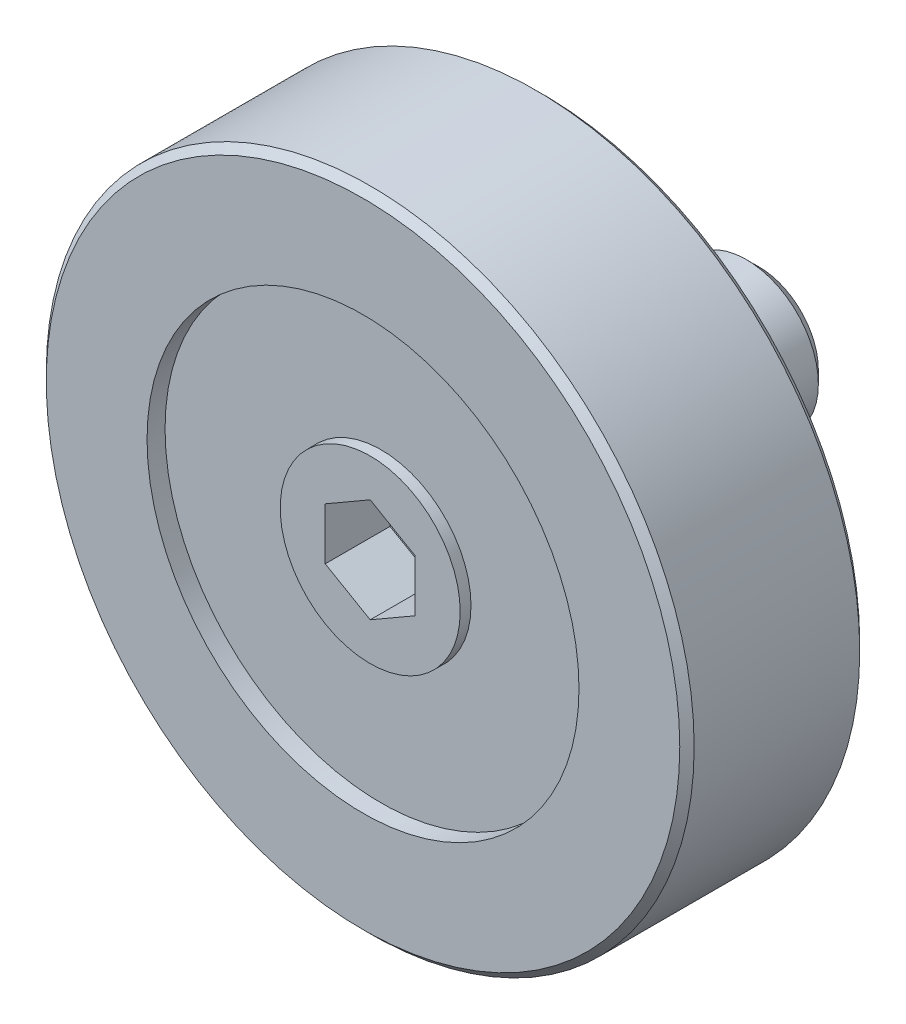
ISO-10303-21;
HEADER;
FILE_DESCRIPTION(('STEP AP214'),'2;1');
FILE_NAME('part.step','',(''),(''),'','','');
FILE_SCHEMA(('AUTOMOTIVE_DESIGN { 1 0 10303 214 1 1 1 1 }'));
ENDSEC;
DATA;
#1=APPLICATION_CONTEXT('core data for automotive mechanical design processes');
#2=APPLICATION_PROTOCOL_DEFINITION('international standard','automotive_design',2000,#1);
#3=PRODUCT_CONTEXT('',#1,'mechanical');
#4=PRODUCT('Part','Part','',(#3));
#5=PRODUCT_RELATED_PRODUCT_CATEGORY('part','',(#4));
#6=PRODUCT_DEFINITION_FORMATION('','',#4);
#7=PRODUCT_DEFINITION_CONTEXT('part definition',#1,'design');
#8=PRODUCT_DEFINITION('design','',#6,#7);
#9=PRODUCT_DEFINITION_SHAPE('','',#8);
#10=(LENGTH_UNIT() NAMED_UNIT(*) SI_UNIT(.MILLI.,.METRE.));
#11=(NAMED_UNIT(*) PLANE_ANGLE_UNIT() SI_UNIT($,.RADIAN.));
#12=(NAMED_UNIT(*) SI_UNIT($,.STERADIAN.) SOLID_ANGLE_UNIT());
#13=UNCERTAINTY_MEASURE_WITH_UNIT(LENGTH_MEASURE(1.E-05),#10,'distance_accuracy_value','');
#14=(GEOMETRIC_REPRESENTATION_CONTEXT(3) GLOBAL_UNCERTAINTY_ASSIGNED_CONTEXT((#13)) GLOBAL_UNIT_ASSIGNED_CONTEXT((#10,
#11,#12)) REPRESENTATION_CONTEXT('',''));
#15=CARTESIAN_POINT('',(0.,0.,0.));
#16=DIRECTION('',(0.,0.,1.));
#17=DIRECTION('',(1.,0.,0.));
#18=AXIS2_PLACEMENT_3D('',#15,#16,#17);
#19=CARTESIAN_POINT('',(0.,8.8,5.99999999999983));
#20=DIRECTION('',(0.,0.,1.));
#21=DIRECTION('',(1.,0.,0.));
#22=AXIS2_PLACEMENT_3D('',#19,#20,#21);
#23=PLANE('',#22);
#24=CARTESIAN_POINT('',(0.,0.,5.99999999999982));
#25=DIRECTION('',(0.,0.,1.));
#26=DIRECTION('',(1.,0.,0.));
#27=AXIS2_PLACEMENT_3D('',#24,#25,#26);
#28=CIRCLE('',#27,8.8);
#29=CARTESIAN_POINT('',(8.8,0.,5.99999999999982));
#30=VERTEX_POINT('',#29);
#31=EDGE_CURVE('E115',#30,#30,#28,.T.);
#32=ORIENTED_EDGE('',*,*,#31,.T.);
#33=EDGE_LOOP('',(#32));
#34=FACE_BOUND('',#33,.T.);
#35=CARTESIAN_POINT('',(0.,0.,5.99999999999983));
#36=DIRECTION('',(0.,0.,1.));
#37=DIRECTION('',(1.,0.,0.));
#38=AXIS2_PLACEMENT_3D('',#35,#36,#37);
#39=CIRCLE('',#38,6.00000000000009);
#40=CARTESIAN_POINT('',(6.00000000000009,0.,5.99999999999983));
#41=VERTEX_POINT('',#40);
#42=EDGE_CURVE('E9',#41,#41,#39,.T.);
#43=ORIENTED_EDGE('',*,*,#42,.F.);
#44=EDGE_LOOP('',(#43));
#45=FACE_BOUND('',#44,.T.);
#46=ADVANCED_FACE('F14',(#34,#45),#23,.T.);
#47=CARTESIAN_POINT('',(0.,0.,9.));
#48=DIRECTION('',(0.,0.,1.));
#49=DIRECTION('',(1.,0.,0.));
#50=AXIS2_PLACEMENT_3D('',#47,#48,#49);
#51=CYLINDRICAL_SURFACE('',#50,6.00000000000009);
#52=ORIENTED_EDGE('',*,*,#42,.T.);
#53=EDGE_LOOP('',(#52));
#54=FACE_BOUND('',#53,.T.);
#55=CARTESIAN_POINT('',(0.,0.,5.49999999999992));
#56=DIRECTION('',(0.,0.,1.));
#57=DIRECTION('',(1.,0.,0.));
#58=AXIS2_PLACEMENT_3D('',#55,#56,#57);
#59=CIRCLE('',#58,6.00000000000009);
#60=CARTESIAN_POINT('',(6.00000000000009,0.,5.49999999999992));
#61=VERTEX_POINT('',#60);
#62=EDGE_CURVE('E21',#61,#61,#59,.T.);
#63=ORIENTED_EDGE('',*,*,#62,.F.);
#64=EDGE_LOOP('',(#63));
#65=FACE_BOUND('',#64,.T.);
#66=ADVANCED_FACE('F170',(#54,#65),#51,.F.);
#67=CARTESIAN_POINT('',(0.,6.00000000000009,5.5));
#68=DIRECTION('',(0.,0.,1.));
#69=DIRECTION('',(1.,0.,0.));
#70=AXIS2_PLACEMENT_3D('',#67,#68,#69);
#71=PLANE('',#70);
#72=ORIENTED_EDGE('',*,*,#62,.T.);
#73=EDGE_LOOP('',(#72));
#74=FACE_BOUND('',#73,.T.);
#75=CARTESIAN_POINT('',(0.,0.,5.5));
#76=DIRECTION('',(0.,0.,1.));
#77=DIRECTION('',(1.,0.,0.));
#78=AXIS2_PLACEMENT_3D('',#75,#76,#77);
#79=CIRCLE('',#78,2.5);
#80=CARTESIAN_POINT('',(2.5,0.,5.5));
#81=VERTEX_POINT('',#80);
#82=EDGE_CURVE('E162',#81,#81,#79,.T.);
#83=ORIENTED_EDGE('',*,*,#82,.F.);
#84=EDGE_LOOP('',(#83));
#85=FACE_BOUND('',#84,.T.);
#86=ADVANCED_FACE('F167',(#74,#85),#71,.T.);
#87=CARTESIAN_POINT('',(0.,0.,9.));
#88=DIRECTION('',(0.,0.,1.));
#89=DIRECTION('',(1.,0.,0.));
#90=AXIS2_PLACEMENT_3D('',#87,#88,#89);
#91=CYLINDRICAL_SURFACE('',#90,2.5);
#92=ORIENTED_EDGE('',*,*,#82,.T.);
#93=EDGE_LOOP('',(#92));
#94=FACE_BOUND('',#93,.T.);
#95=CARTESIAN_POINT('',(0.,0.,5.8));
#96=DIRECTION('',(0.,0.,1.));
#97=DIRECTION('',(1.,0.,0.));
#98=AXIS2_PLACEMENT_3D('',#95,#96,#97);
#99=CIRCLE('',#98,2.5);
#100=CARTESIAN_POINT('',(2.5,0.,5.8));
#101=VERTEX_POINT('',#100);
#102=EDGE_CURVE('E159',#101,#101,#99,.T.);
#103=ORIENTED_EDGE('',*,*,#102,.F.);
#104=EDGE_LOOP('',(#103));
#105=FACE_BOUND('',#104,.T.);
#106=ADVANCED_FACE('F179',(#94,#105),#91,.T.);
#107=CARTESIAN_POINT('',(0.,2.5,5.8));
#108=DIRECTION('',(0.,0.,1.));
#109=DIRECTION('',(1.,0.,0.));
#110=AXIS2_PLACEMENT_3D('',#107,#108,#109);
#111=PLANE('',#110);
#112=DIRECTION('',(-0.866025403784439,0.5,0.));
#113=VECTOR('',#112,1.);
#114=CARTESIAN_POINT('',(1.25,0.721687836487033,5.8));
#115=LINE('',#114,#113);
#116=CARTESIAN_POINT('',(1.25,0.721687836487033,5.8));
#117=VERTEX_POINT('',#116);
#118=CARTESIAN_POINT('',(0.,1.44337567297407,5.8));
#119=VERTEX_POINT('',#118);
#120=EDGE_CURVE('E28',#117,#119,#115,.T.);
#121=ORIENTED_EDGE('',*,*,#120,.F.);
#122=DIRECTION('',(0.,1.,0.));
#123=VECTOR('',#122,1.);
#124=CARTESIAN_POINT('',(1.25,-0.721687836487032,5.8));
#125=LINE('',#124,#123);
#126=CARTESIAN_POINT('',(1.25,-0.721687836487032,5.8));
#127=VERTEX_POINT('',#126);
#128=EDGE_CURVE('E111',#127,#117,#125,.T.);
#129=ORIENTED_EDGE('',*,*,#128,.F.);
#130=DIRECTION('',(0.866025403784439,0.5,0.));
#131=VECTOR('',#130,1.);
#132=CARTESIAN_POINT('',(0.,-1.44337567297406,5.8));
#133=LINE('',#132,#131);
#134=CARTESIAN_POINT('',(0.,-1.44337567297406,5.8));
#135=VERTEX_POINT('',#134);
#136=EDGE_CURVE('E109',#135,#127,#133,.T.);
#137=ORIENTED_EDGE('',*,*,#136,.F.);
#138=DIRECTION('',(0.866025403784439,-0.5,0.));
#139=VECTOR('',#138,1.);
#140=CARTESIAN_POINT('',(-1.25,-0.721687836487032,5.8));
#141=LINE('',#140,#139);
#142=CARTESIAN_POINT('',(-1.25,-0.721687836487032,5.8));
#143=VERTEX_POINT('',#142);
#144=EDGE_CURVE('E76',#143,#135,#141,.T.);
#145=ORIENTED_EDGE('',*,*,#144,.F.);
#146=DIRECTION('',(0.,-1.,0.));
#147=VECTOR('',#146,1.);
#148=CARTESIAN_POINT('',(-1.25,0.721687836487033,5.8));
#149=LINE('',#148,#147);
#150=CARTESIAN_POINT('',(-1.25,0.721687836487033,5.8));
#151=VERTEX_POINT('',#150);
#152=EDGE_CURVE('E105',#151,#143,#149,.T.);
#153=ORIENTED_EDGE('',*,*,#152,.F.);
#154=DIRECTION('',(-0.866025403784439,-0.5,0.));
#155=VECTOR('',#154,1.);
#156=CARTESIAN_POINT('',(0.,1.44337567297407,5.8));
#157=LINE('',#156,#155);
#158=EDGE_CURVE('E102',#119,#151,#157,.T.);
#159=ORIENTED_EDGE('',*,*,#158,.F.);
#160=EDGE_LOOP('',(#121,#129,#137,#145,#153,#159));
#161=FACE_BOUND('',#160,.T.);
#162=ORIENTED_EDGE('',*,*,#102,.T.);
#163=EDGE_LOOP('',(#162));
#164=FACE_BOUND('',#163,.T.);
#165=ADVANCED_FACE('F185',(#161,#164),#111,.T.);
#166=CARTESIAN_POINT('',(0.,0.,-5.));
#167=DIRECTION('',(0.,0.,-1.));
#168=DIRECTION('',(-1.,0.,0.));
#169=AXIS2_PLACEMENT_3D('',#166,#167,#168);
#170=PLANE('',#169);
#171=CARTESIAN_POINT('',(0.,0.,-5.));
#172=DIRECTION('',(0.,0.,1.));
#173=DIRECTION('',(1.,0.,0.));
#174=AXIS2_PLACEMENT_3D('',#171,#172,#173);
#175=CIRCLE('',#174,1.65);
#176=CARTESIAN_POINT('',(1.65,0.,-5.));
#177=VERTEX_POINT('',#176);
#178=EDGE_CURVE('E156',#177,#177,#175,.T.);
#179=ORIENTED_EDGE('',*,*,#178,.F.);
#180=EDGE_LOOP('',(#179));
#181=FACE_BOUND('',#180,.T.);
#182=ADVANCED_FACE('F189',(#181),#170,.T.);
#183=CARTESIAN_POINT('',(0.,0.,-4.65));
#184=DIRECTION('',(0.,0.,1.));
#185=DIRECTION('',(1.,0.,0.));
#186=AXIS2_PLACEMENT_3D('',#183,#184,#185);
#187=CONICAL_SURFACE('',#186,2.,0.785398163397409);
#188=ORIENTED_EDGE('',*,*,#178,.T.);
#189=EDGE_LOOP('',(#188));
#190=FACE_BOUND('',#189,.T.);
#191=CARTESIAN_POINT('',(0.,0.,-4.65));
#192=DIRECTION('',(0.,0.,1.));
#193=DIRECTION('',(1.,0.,0.));
#194=AXIS2_PLACEMENT_3D('',#191,#192,#193);
#195=CIRCLE('',#194,2.);
#196=CARTESIAN_POINT('',(2.,0.,-4.65));
#197=VERTEX_POINT('',#196);
#198=EDGE_CURVE('E153',#197,#197,#195,.T.);
#199=ORIENTED_EDGE('',*,*,#198,.F.);
#200=EDGE_LOOP('',(#199));
#201=FACE_BOUND('',#200,.T.);
#202=ADVANCED_FACE('F193',(#190,#201),#187,.T.);
#203=CARTESIAN_POINT('',(0.,0.,9.));
#204=DIRECTION('',(0.,0.,1.));
#205=DIRECTION('',(1.,0.,0.));
#206=AXIS2_PLACEMENT_3D('',#203,#204,#205);
#207=CYLINDRICAL_SURFACE('',#206,2.);
#208=ORIENTED_EDGE('',*,*,#198,.T.);
#209=EDGE_LOOP('',(#208));
#210=FACE_BOUND('',#209,.T.);
#211=CARTESIAN_POINT('',(0.,0.,-1.));
#212=DIRECTION('',(0.,0.,1.));
#213=DIRECTION('',(1.,0.,0.));
#214=AXIS2_PLACEMENT_3D('',#211,#212,#213);
#215=CIRCLE('',#214,2.);
#216=CARTESIAN_POINT('',(2.,0.,-1.));
#217=VERTEX_POINT('',#216);
#218=EDGE_CURVE('E150',#217,#217,#215,.T.);
#219=ORIENTED_EDGE('',*,*,#218,.F.);
#220=EDGE_LOOP('',(#219));
#221=FACE_BOUND('',#220,.T.);
#222=ADVANCED_FACE('F197',(#210,#221),#207,.T.);
#223=CARTESIAN_POINT('',(0.,1.45000000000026,-1.));
#224=DIRECTION('',(0.,0.,1.));
#225=DIRECTION('',(1.,0.,0.));
#226=AXIS2_PLACEMENT_3D('',#223,#224,#225);
#227=PLANE('',#226);
#228=ORIENTED_EDGE('',*,*,#218,.T.);
#229=EDGE_LOOP('',(#228));
#230=FACE_BOUND('',#229,.T.);
#231=CARTESIAN_POINT('',(0.,0.,-1.00000000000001));
#232=DIRECTION('',(0.,0.,1.));
#233=DIRECTION('',(1.,0.,0.));
#234=AXIS2_PLACEMENT_3D('',#231,#232,#233);
#235=CIRCLE('',#234,1.45000000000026);
#236=CARTESIAN_POINT('',(1.45000000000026,0.,-1.00000000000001));
#237=VERTEX_POINT('',#236);
#238=EDGE_CURVE('E147',#237,#237,#235,.T.);
#239=ORIENTED_EDGE('',*,*,#238,.F.);
#240=EDGE_LOOP('',(#239));
#241=FACE_BOUND('',#240,.T.);
#242=ADVANCED_FACE('F201',(#230,#241),#227,.T.);
#243=CARTESIAN_POINT('',(0.,0.,9.));
#244=DIRECTION('',(0.,0.,1.));
#245=DIRECTION('',(1.,0.,0.));
#246=AXIS2_PLACEMENT_3D('',#243,#244,#245);
#247=CYLINDRICAL_SURFACE('',#246,1.45000000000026);
#248=ORIENTED_EDGE('',*,*,#238,.T.);
#249=EDGE_LOOP('',(#248));
#250=FACE_BOUND('',#249,.T.);
#251=CARTESIAN_POINT('',(0.,0.,0.));
#252=DIRECTION('',(0.,0.,1.));
#253=DIRECTION('',(1.,0.,0.));
#254=AXIS2_PLACEMENT_3D('',#251,#252,#253);
#255=CIRCLE('',#254,1.45000000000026);
#256=CARTESIAN_POINT('',(1.45000000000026,0.,0.));
#257=VERTEX_POINT('',#256);
#258=EDGE_CURVE('E144',#257,#257,#255,.T.);
#259=ORIENTED_EDGE('',*,*,#258,.F.);
#260=EDGE_LOOP('',(#259));
#261=FACE_BOUND('',#260,.T.);
#262=ADVANCED_FACE('F205',(#250,#261),#247,.T.);
#263=CARTESIAN_POINT('',(0.,3.50000000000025,0.));
#264=DIRECTION('',(0.,0.,-1.));
#265=DIRECTION('',(-1.,0.,0.));
#266=AXIS2_PLACEMENT_3D('',#263,#264,#265);
#267=PLANE('',#266);
#268=ORIENTED_EDGE('',*,*,#258,.T.);
#269=EDGE_LOOP('',(#268));
#270=FACE_BOUND('',#269,.T.);
#271=CARTESIAN_POINT('',(0.,0.,0.));
#272=DIRECTION('',(0.,0.,1.));
#273=DIRECTION('',(1.,0.,0.));
#274=AXIS2_PLACEMENT_3D('',#271,#272,#273);
#275=CIRCLE('',#274,3.50000000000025);
#276=CARTESIAN_POINT('',(3.50000000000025,0.,0.));
#277=VERTEX_POINT('',#276);
#278=EDGE_CURVE('E141',#277,#277,#275,.T.);
#279=ORIENTED_EDGE('',*,*,#278,.F.);
#280=EDGE_LOOP('',(#279));
#281=FACE_BOUND('',#280,.T.);
#282=ADVANCED_FACE('F209',(#270,#281),#267,.T.);
#283=CARTESIAN_POINT('',(0.,0.,9.));
#284=DIRECTION('',(0.,0.,1.));
#285=DIRECTION('',(1.,0.,0.));
#286=AXIS2_PLACEMENT_3D('',#283,#284,#285);
#287=CYLINDRICAL_SURFACE('',#286,3.50000000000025);
#288=ORIENTED_EDGE('',*,*,#278,.T.);
#289=EDGE_LOOP('',(#288));
#290=FACE_BOUND('',#289,.T.);
#291=CARTESIAN_POINT('',(0.,0.,1.49999999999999));
#292=DIRECTION('',(0.,0.,1.));
#293=DIRECTION('',(1.,0.,0.));
#294=AXIS2_PLACEMENT_3D('',#291,#292,#293);
#295=CIRCLE('',#294,3.50000000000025);
#296=CARTESIAN_POINT('',(3.50000000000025,0.,1.49999999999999));
#297=VERTEX_POINT('',#296);
#298=EDGE_CURVE('E138',#297,#297,#295,.T.);
#299=ORIENTED_EDGE('',*,*,#298,.F.);
#300=EDGE_LOOP('',(#299));
#301=FACE_BOUND('',#300,.T.);
#302=ADVANCED_FACE('F213',(#290,#301),#287,.T.);
#303=CARTESIAN_POINT('',(0.,3.50000000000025,1.49999999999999));
#304=DIRECTION('',(0.,0.,-1.));
#305=DIRECTION('',(-1.,0.,0.));
#306=AXIS2_PLACEMENT_3D('',#303,#304,#305);
#307=PLANE('',#306);
#308=ORIENTED_EDGE('',*,*,#298,.T.);
#309=EDGE_LOOP('',(#308));
#310=FACE_BOUND('',#309,.T.);
#311=CARTESIAN_POINT('',(0.,0.,1.49999999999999));
#312=DIRECTION('',(0.,0.,1.));
#313=DIRECTION('',(1.,0.,0.));
#314=AXIS2_PLACEMENT_3D('',#311,#312,#313);
#315=CIRCLE('',#314,6.00000000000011);
#316=CARTESIAN_POINT('',(6.00000000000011,0.,1.49999999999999));
#317=VERTEX_POINT('',#316);
#318=EDGE_CURVE('E135',#317,#317,#315,.T.);
#319=ORIENTED_EDGE('',*,*,#318,.F.);
#320=EDGE_LOOP('',(#319));
#321=FACE_BOUND('',#320,.T.);
#322=ADVANCED_FACE('F217',(#310,#321),#307,.T.);
#323=CARTESIAN_POINT('',(0.,0.,9.));
#324=DIRECTION('',(0.,0.,1.));
#325=DIRECTION('',(1.,0.,0.));
#326=AXIS2_PLACEMENT_3D('',#323,#324,#325);
#327=CYLINDRICAL_SURFACE('',#326,6.00000000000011);
#328=ORIENTED_EDGE('',*,*,#318,.T.);
#329=EDGE_LOOP('',(#328));
#330=FACE_BOUND('',#329,.T.);
#331=CARTESIAN_POINT('',(0.,0.,0.999999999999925));
#332=DIRECTION('',(0.,0.,1.));
#333=DIRECTION('',(1.,0.,0.));
#334=AXIS2_PLACEMENT_3D('',#331,#332,#333);
#335=CIRCLE('',#334,6.00000000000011);
#336=CARTESIAN_POINT('',(6.00000000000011,0.,0.999999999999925));
#337=VERTEX_POINT('',#336);
#338=EDGE_CURVE('E132',#337,#337,#335,.T.);
#339=ORIENTED_EDGE('',*,*,#338,.F.);
#340=EDGE_LOOP('',(#339));
#341=FACE_BOUND('',#340,.T.);
#342=ADVANCED_FACE('F221',(#330,#341),#327,.F.);
#343=CARTESIAN_POINT('',(0.,8.8,0.999999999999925));
#344=DIRECTION('',(0.,0.,-1.));
#345=DIRECTION('',(-1.,0.,0.));
#346=AXIS2_PLACEMENT_3D('',#343,#344,#345);
#347=PLANE('',#346);
#348=ORIENTED_EDGE('',*,*,#338,.T.);
#349=EDGE_LOOP('',(#348));
#350=FACE_BOUND('',#349,.T.);
#351=CARTESIAN_POINT('',(0.,0.,0.999999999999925));
#352=DIRECTION('',(0.,0.,1.));
#353=DIRECTION('',(1.,0.,0.));
#354=AXIS2_PLACEMENT_3D('',#351,#352,#353);
#355=CIRCLE('',#354,8.8);
#356=CARTESIAN_POINT('',(8.8,0.,0.999999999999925));
#357=VERTEX_POINT('',#356);
#358=EDGE_CURVE('E129',#357,#357,#355,.T.);
#359=ORIENTED_EDGE('',*,*,#358,.F.);
#360=EDGE_LOOP('',(#359));
#361=FACE_BOUND('',#360,.T.);
#362=ADVANCED_FACE('F225',(#350,#361),#347,.T.);
#363=CARTESIAN_POINT('',(0.,0.,1.19999999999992));
#364=DIRECTION('',(0.,0.,1.));
#365=DIRECTION('',(1.,0.,0.));
#366=AXIS2_PLACEMENT_3D('',#363,#364,#365);
#367=CONICAL_SURFACE('',#366,9.,0.785398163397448);
#368=ORIENTED_EDGE('',*,*,#358,.T.);
#369=EDGE_LOOP('',(#368));
#370=FACE_BOUND('',#369,.T.);
#371=CARTESIAN_POINT('',(0.,0.,1.19999999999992));
#372=DIRECTION('',(0.,0.,1.));
#373=DIRECTION('',(1.,0.,0.));
#374=AXIS2_PLACEMENT_3D('',#371,#372,#373);
#375=CIRCLE('',#374,9.);
#376=CARTESIAN_POINT('',(9.,0.,1.19999999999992));
#377=VERTEX_POINT('',#376);
#378=EDGE_CURVE('E126',#377,#377,#375,.T.);
#379=ORIENTED_EDGE('',*,*,#378,.F.);
#380=EDGE_LOOP('',(#379));
#381=FACE_BOUND('',#380,.T.);
#382=ADVANCED_FACE('F229',(#370,#381),#367,.T.);
#383=CARTESIAN_POINT('',(0.,0.,9.));
#384=DIRECTION('',(0.,0.,1.));
#385=DIRECTION('',(1.,0.,0.));
#386=AXIS2_PLACEMENT_3D('',#383,#384,#385);
#387=CYLINDRICAL_SURFACE('',#386,9.);
#388=ORIENTED_EDGE('',*,*,#378,.T.);
#389=EDGE_LOOP('',(#388));
#390=FACE_BOUND('',#389,.T.);
#391=CARTESIAN_POINT('',(0.,0.,5.79999999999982));
#392=DIRECTION('',(0.,0.,1.));
#393=DIRECTION('',(1.,0.,0.));
#394=AXIS2_PLACEMENT_3D('',#391,#392,#393);
#395=CIRCLE('',#394,9.);
#396=CARTESIAN_POINT('',(9.,0.,5.79999999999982));
#397=VERTEX_POINT('',#396);
#398=EDGE_CURVE('E123',#397,#397,#395,.T.);
#399=ORIENTED_EDGE('',*,*,#398,.F.);
#400=EDGE_LOOP('',(#399));
#401=FACE_BOUND('',#400,.T.);
#402=ADVANCED_FACE('F233',(#390,#401),#387,.T.);
#403=CARTESIAN_POINT('',(0.,0.,5.99999999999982));
#404=DIRECTION('',(0.,0.,-1.));
#405=DIRECTION('',(-1.,0.,0.));
#406=AXIS2_PLACEMENT_3D('',#403,#404,#405);
#407=CONICAL_SURFACE('',#406,8.8,0.785398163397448);
#408=ORIENTED_EDGE('',*,*,#398,.T.);
#409=EDGE_LOOP('',(#408));
#410=FACE_BOUND('',#409,.T.);
#411=ORIENTED_EDGE('',*,*,#31,.F.);
#412=EDGE_LOOP('',(#411));
#413=FACE_BOUND('',#412,.T.);
#414=ADVANCED_FACE('F237',(#410,#413),#407,.T.);
#415=CARTESIAN_POINT('',(1.25,0.721687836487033,4.));
#416=DIRECTION('',(0.5,0.866025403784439,0.));
#417=DIRECTION('',(-0.866025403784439,0.5,0.));
#418=AXIS2_PLACEMENT_3D('',#415,#416,#417);
#419=PLANE('',#418);
#420=ORIENTED_EDGE('',*,*,#120,.T.);
#421=DIRECTION('',(0.,0.,1.));
#422=VECTOR('',#421,1.);
#423=CARTESIAN_POINT('',(0.,1.44337567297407,4.));
#424=LINE('',#423,#422);
#425=CARTESIAN_POINT('',(0.,1.44337567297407,4.));
#426=VERTEX_POINT('',#425);
#427=EDGE_CURVE('E58',#426,#119,#424,.T.);
#428=ORIENTED_EDGE('',*,*,#427,.F.);
#429=DIRECTION('',(-0.866025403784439,0.5,0.));
#430=VECTOR('',#429,1.);
#431=CARTESIAN_POINT('',(1.25,0.721687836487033,4.));
#432=LINE('',#431,#430);
#433=CARTESIAN_POINT('',(1.25,0.721687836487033,4.));
#434=VERTEX_POINT('',#433);
#435=EDGE_CURVE('E113',#434,#426,#432,.T.);
#436=ORIENTED_EDGE('',*,*,#435,.F.);
#437=DIRECTION('',(0.,0.,1.));
#438=VECTOR('',#437,1.);
#439=CARTESIAN_POINT('',(1.25,0.721687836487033,4.));
#440=LINE('',#439,#438);
#441=EDGE_CURVE('E36',#434,#117,#440,.T.);
#442=ORIENTED_EDGE('',*,*,#441,.T.);
#443=EDGE_LOOP('',(#420,#428,#436,#442));
#444=FACE_BOUND('',#443,.T.);
#445=ADVANCED_FACE('F241',(#444),#419,.F.);
#446=CARTESIAN_POINT('',(1.25,-0.721687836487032,4.));
#447=DIRECTION('',(1.,0.,0.));
#448=DIRECTION('',(0.,0.,-1.));
#449=AXIS2_PLACEMENT_3D('',#446,#447,#448);
#450=PLANE('',#449);
#451=ORIENTED_EDGE('',*,*,#128,.T.);
#452=ORIENTED_EDGE('',*,*,#441,.F.);
#453=DIRECTION('',(0.,1.,0.));
#454=VECTOR('',#453,1.);
#455=CARTESIAN_POINT('',(1.25,-0.721687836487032,4.));
#456=LINE('',#455,#454);
#457=CARTESIAN_POINT('',(1.25,-0.721687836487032,4.));
#458=VERTEX_POINT('',#457);
#459=EDGE_CURVE('E88',#458,#434,#456,.T.);
#460=ORIENTED_EDGE('',*,*,#459,.F.);
#461=DIRECTION('',(0.,0.,1.));
#462=VECTOR('',#461,1.);
#463=CARTESIAN_POINT('',(1.25,-0.721687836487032,4.));
#464=LINE('',#463,#462);
#465=EDGE_CURVE('E80',#458,#127,#464,.T.);
#466=ORIENTED_EDGE('',*,*,#465,.T.);
#467=EDGE_LOOP('',(#451,#452,#460,#466));
#468=FACE_BOUND('',#467,.T.);
#469=ADVANCED_FACE('F245',(#468),#450,.F.);
#470=CARTESIAN_POINT('',(0.,-1.44337567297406,4.));
#471=DIRECTION('',(0.5,-0.866025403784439,0.));
#472=DIRECTION('',(0.866025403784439,0.5,0.));
#473=AXIS2_PLACEMENT_3D('',#470,#471,#472);
#474=PLANE('',#473);
#475=ORIENTED_EDGE('',*,*,#136,.T.);
#476=ORIENTED_EDGE('',*,*,#465,.F.);
#477=DIRECTION('',(0.866025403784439,0.5,0.));
#478=VECTOR('',#477,1.);
#479=CARTESIAN_POINT('',(0.,-1.44337567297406,4.));
#480=LINE('',#479,#478);
#481=CARTESIAN_POINT('',(0.,-1.44337567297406,4.));
#482=VERTEX_POINT('',#481);
#483=EDGE_CURVE('E84',#482,#458,#480,.T.);
#484=ORIENTED_EDGE('',*,*,#483,.F.);
#485=DIRECTION('',(0.,0.,1.));
#486=VECTOR('',#485,1.);
#487=CARTESIAN_POINT('',(0.,-1.44337567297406,4.));
#488=LINE('',#487,#486);
#489=EDGE_CURVE('E69',#482,#135,#488,.T.);
#490=ORIENTED_EDGE('',*,*,#489,.T.);
#491=EDGE_LOOP('',(#475,#476,#484,#490));
#492=FACE_BOUND('',#491,.T.);
#493=ADVANCED_FACE('F85',(#492),#474,.F.);
#494=CARTESIAN_POINT('',(-1.25,-0.721687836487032,4.));
#495=DIRECTION('',(-0.5,-0.866025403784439,0.));
#496=DIRECTION('',(0.866025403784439,-0.5,0.));
#497=AXIS2_PLACEMENT_3D('',#494,#495,#496);
#498=PLANE('',#497);
#499=ORIENTED_EDGE('',*,*,#144,.T.);
#500=ORIENTED_EDGE('',*,*,#489,.F.);
#501=DIRECTION('',(0.866025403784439,-0.5,0.));
#502=VECTOR('',#501,1.);
#503=CARTESIAN_POINT('',(-1.25,-0.721687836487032,4.));
#504=LINE('',#503,#502);
#505=CARTESIAN_POINT('',(-1.25,-0.721687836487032,4.));
#506=VERTEX_POINT('',#505);
#507=EDGE_CURVE('E73',#506,#482,#504,.T.);
#508=ORIENTED_EDGE('',*,*,#507,.F.);
#509=DIRECTION('',(0.,0.,1.));
#510=VECTOR('',#509,1.);
#511=CARTESIAN_POINT('',(-1.25,-0.721687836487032,4.));
#512=LINE('',#511,#510);
#513=EDGE_CURVE('E81',#506,#143,#512,.T.);
#514=ORIENTED_EDGE('',*,*,#513,.T.);
#515=EDGE_LOOP('',(#499,#500,#508,#514));
#516=FACE_BOUND('',#515,.T.);
#517=ADVANCED_FACE('F71',(#516),#498,.F.);
#518=CARTESIAN_POINT('',(-1.25,0.721687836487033,4.));
#519=DIRECTION('',(-1.,0.,0.));
#520=DIRECTION('',(0.,-1.,0.));
#521=AXIS2_PLACEMENT_3D('',#518,#519,#520);
#522=PLANE('',#521);
#523=ORIENTED_EDGE('',*,*,#152,.T.);
#524=ORIENTED_EDGE('',*,*,#513,.F.);
#525=DIRECTION('',(0.,-1.,0.));
#526=VECTOR('',#525,1.);
#527=CARTESIAN_POINT('',(-1.25,0.721687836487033,4.));
#528=LINE('',#527,#526);
#529=CARTESIAN_POINT('',(-1.25,0.721687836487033,4.));
#530=VERTEX_POINT('',#529);
#531=EDGE_CURVE('E94',#530,#506,#528,.T.);
#532=ORIENTED_EDGE('',*,*,#531,.F.);
#533=DIRECTION('',(0.,0.,1.));
#534=VECTOR('',#533,1.);
#535=CARTESIAN_POINT('',(-1.25,0.721687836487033,4.));
#536=LINE('',#535,#534);
#537=EDGE_CURVE('E118',#530,#151,#536,.T.);
#538=ORIENTED_EDGE('',*,*,#537,.T.);
#539=EDGE_LOOP('',(#523,#524,#532,#538));
#540=FACE_BOUND('',#539,.T.);
#541=ADVANCED_FACE('F249',(#540),#522,.F.);
#542=CARTESIAN_POINT('',(0.,1.44337567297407,4.));
#543=DIRECTION('',(-0.5,0.866025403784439,0.));
#544=DIRECTION('',(-0.866025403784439,-0.5,0.));
#545=AXIS2_PLACEMENT_3D('',#542,#543,#544);
#546=PLANE('',#545);
#547=ORIENTED_EDGE('',*,*,#158,.T.);
#548=ORIENTED_EDGE('',*,*,#537,.F.);
#549=DIRECTION('',(-0.866025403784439,-0.5,0.));
#550=VECTOR('',#549,1.);
#551=CARTESIAN_POINT('',(0.,1.44337567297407,4.));
#552=LINE('',#551,#550);
#553=EDGE_CURVE('E96',#426,#530,#552,.T.);
#554=ORIENTED_EDGE('',*,*,#553,.F.);
#555=ORIENTED_EDGE('',*,*,#427,.T.);
#556=EDGE_LOOP('',(#547,#548,#554,#555));
#557=FACE_BOUND('',#556,.T.);
#558=ADVANCED_FACE('F246',(#557),#546,.F.);
#559=CARTESIAN_POINT('',(0.,0.,4.));
#560=DIRECTION('',(0.,0.,1.));
#561=DIRECTION('',(1.,0.,0.));
#562=AXIS2_PLACEMENT_3D('',#559,#560,#561);
#563=PLANE('',#562);
#564=ORIENTED_EDGE('',*,*,#435,.T.);
#565=ORIENTED_EDGE('',*,*,#553,.T.);
#566=ORIENTED_EDGE('',*,*,#531,.T.);
#567=ORIENTED_EDGE('',*,*,#507,.T.);
#568=ORIENTED_EDGE('',*,*,#483,.T.);
#569=ORIENTED_EDGE('',*,*,#459,.T.);
#570=EDGE_LOOP('',(#564,#565,#566,#567,#568,#569));
#571=FACE_BOUND('',#570,.T.);
#572=ADVANCED_FACE('F91',(#571),#563,.T.);
#573=CLOSED_SHELL('',(#46,#66,#86,#106,#165,#182,#202,#222,#242,#262,#282,#302,#322,#342,#362,
#382,#402,#414,#445,#469,#493,#517,#541,#558,#572));
#574=MANIFOLD_SOLID_BREP('B1',#573);
#575=ADVANCED_BREP_SHAPE_REPRESENTATION('',(#18,#574),#14);
#576=SHAPE_DEFINITION_REPRESENTATION(#9,#575);
ENDSEC;
END-ISO-10303-21;
